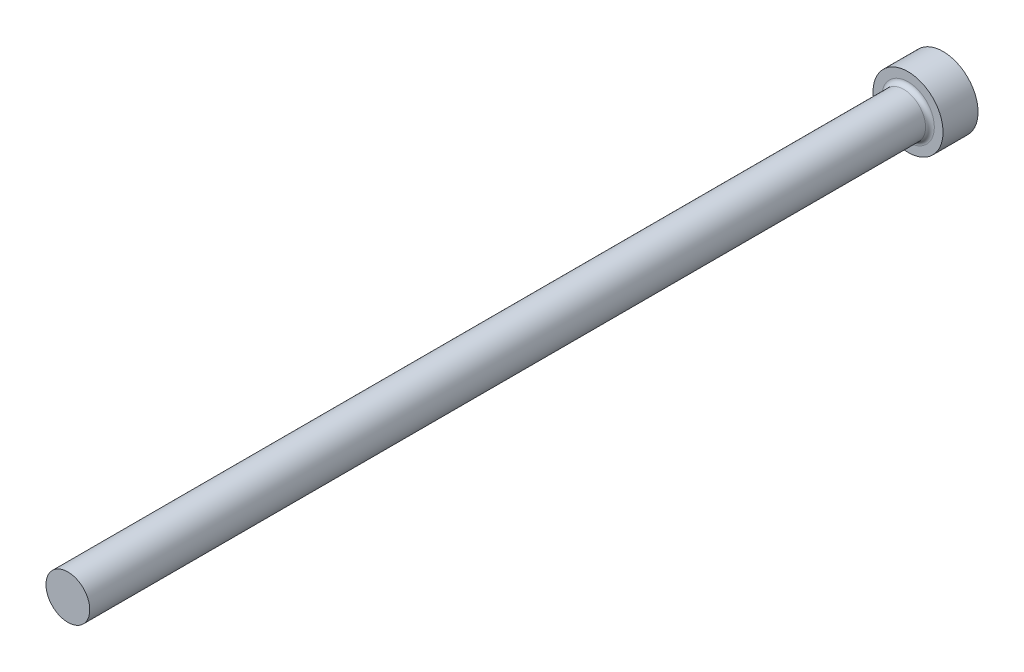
from build123d import *

# Parameters (mm, degrees)
FILLET1_R = 0.5


with BuildPart() as part:
    # FV → Revolve1 (revolve)
    with BuildSketch(Plane(origin=(0, 0, 0), x_dir=(1, 0, 0), z_dir=(0, 1, 0)), mode=Mode.PRIVATE) as revolve1_sk:
        Polygon((0, 0), (4, 0), (4, -4), (2.5, -4), (2.5, -100), (0, -100), align=None)
    revolve(revolve1_sk.sketch.rotate(Axis((0, 0, -9.033228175), (0, 0, 1)), 180), axis=Axis((0, 0, -9.033228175), (0, 0, 1)))

    # Fillet1
    fillet1_edges = [part.edges().sort_by_distance(p)[0] for p in [
        (2.5, 0, 4),
    ]]
    fillet(fillet1_edges, radius=FILLET1_R)


solid = part.part
